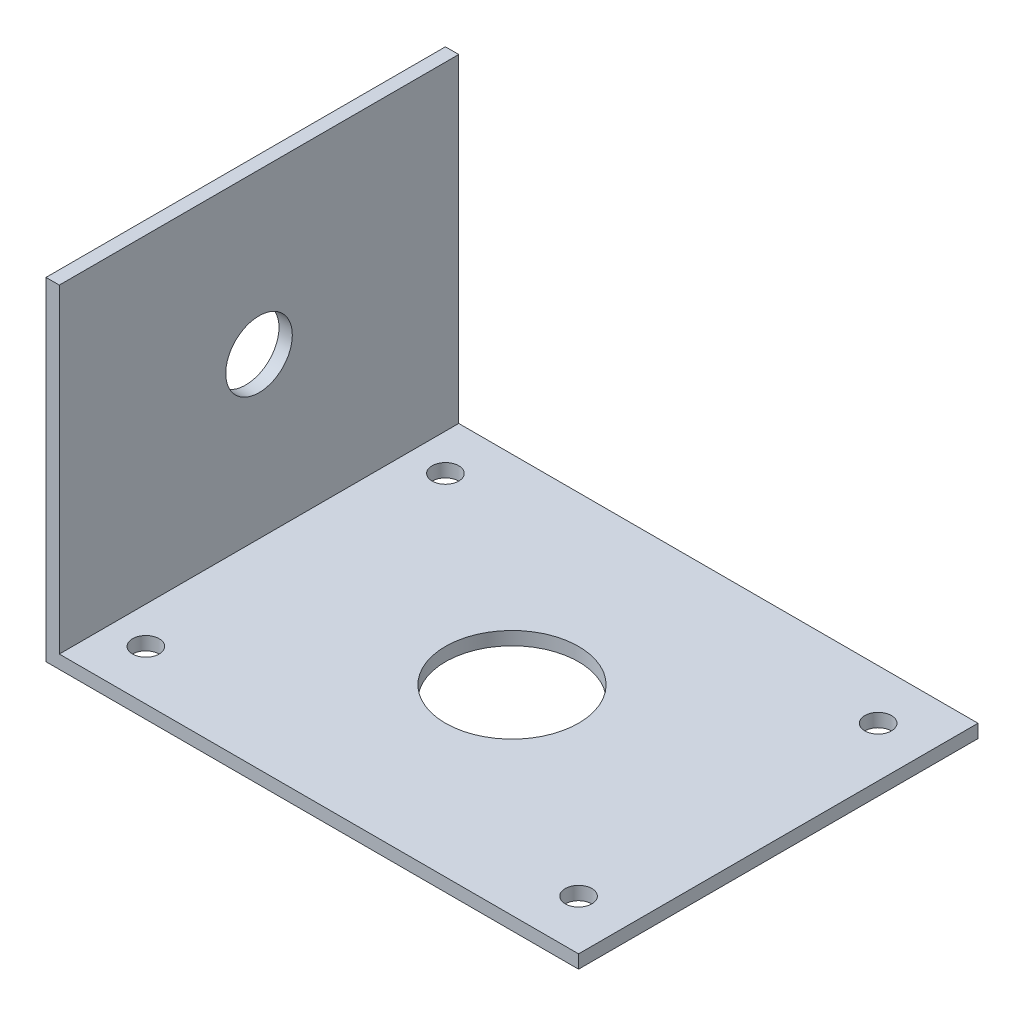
from build123d import *

# Parameters (mm, degrees)
EXTRUDE_THIN1_DEPTH = 76.2
SKETCH2_R           = 6.35
CUT_EXTRUDE1_DEPTH  = 141.184070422
SKETCH3_R           = 12.7
CUT_EXTRUDE2_DEPTH  = 141.872714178
SKETCH4_R           = 2.54
CUT_EXTRUDE3_DEPTH  = 141.872714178


with BuildPart() as part:
    # Sketch1 → Extrude-Thin1 (new body)
    with BuildSketch(Plane.XY):
        Polygon((0, 63.5), (0, 0), (101.6, 0), (101.6, 2.54), (2.54, 2.54), (2.54, 63.5), align=None)
    extrude(amount=EXTRUDE_THIN1_DEPTH)

    # Sketch2 → Cut-Extrude1 (cut, through all)
    with BuildSketch(Plane(origin=(2.54, 0, 0), x_dir=(0, 0, -1), z_dir=(1, 0, 0))):
        with Locations((-38.1, 33.02)):
            Circle(SKETCH2_R)
    extrude(amount=-CUT_EXTRUDE1_DEPTH, mode=Mode.SUBTRACT)

    # Sketch3 → Cut-Extrude2 (cut, through all)
    with BuildSketch(Plane(origin=(0, 2.54, 0), x_dir=(1, 0, 0), z_dir=(0, 1, 0))):
        with Locations(Location((50.8, -38.1, 0), (0, 0, 270))):
            Circle(SKETCH3_R)
    extrude(amount=-CUT_EXTRUDE2_DEPTH, mode=Mode.SUBTRACT)

    # Sketch4 → Cut-Extrude3 (cut, through all)
    with BuildSketch(Plane(origin=(0, 2.54, 0), x_dir=(1, 0, 0), z_dir=(0, 1, 0))):
        with Locations(Location((9.525, -66.675, 0), (0, 0, 270))):
            Circle(SKETCH4_R)
        with Locations(Location((9.525, -9.525, 0), (0, 0, 270))):
            Circle(SKETCH4_R)
        with Locations(Location((92.075, -9.525, 0), (0, 0, 270))):
            Circle(SKETCH4_R)
        with Locations(Location((92.075, -66.675, 0), (0, 0, 270))):
            Circle(SKETCH4_R)
    extrude(amount=-CUT_EXTRUDE3_DEPTH, mode=Mode.SUBTRACT)


solid = part.part
